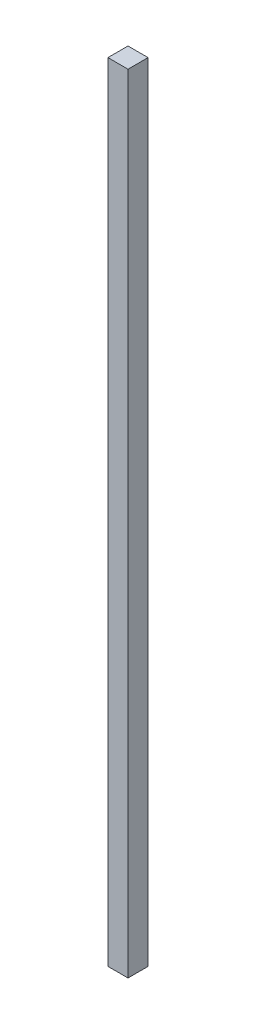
from build123d import *

# Parameters (mm, degrees)
ESQUISSE1_W      = 50
ESQUISSE1_H      = 50
EXTRUSION1_DEPTH = 1960


with BuildPart() as part:
    # Esquisse1 → Extrusion1 (new body)
    with BuildSketch(Plane(origin=(0, 0, 0), x_dir=(1, 0, 0), z_dir=(0, 1, 0))):
        with Locations((25, 25)):
            Rectangle(ESQUISSE1_W, ESQUISSE1_H)
    extrude(amount=EXTRUSION1_DEPTH)


solid = part.part
